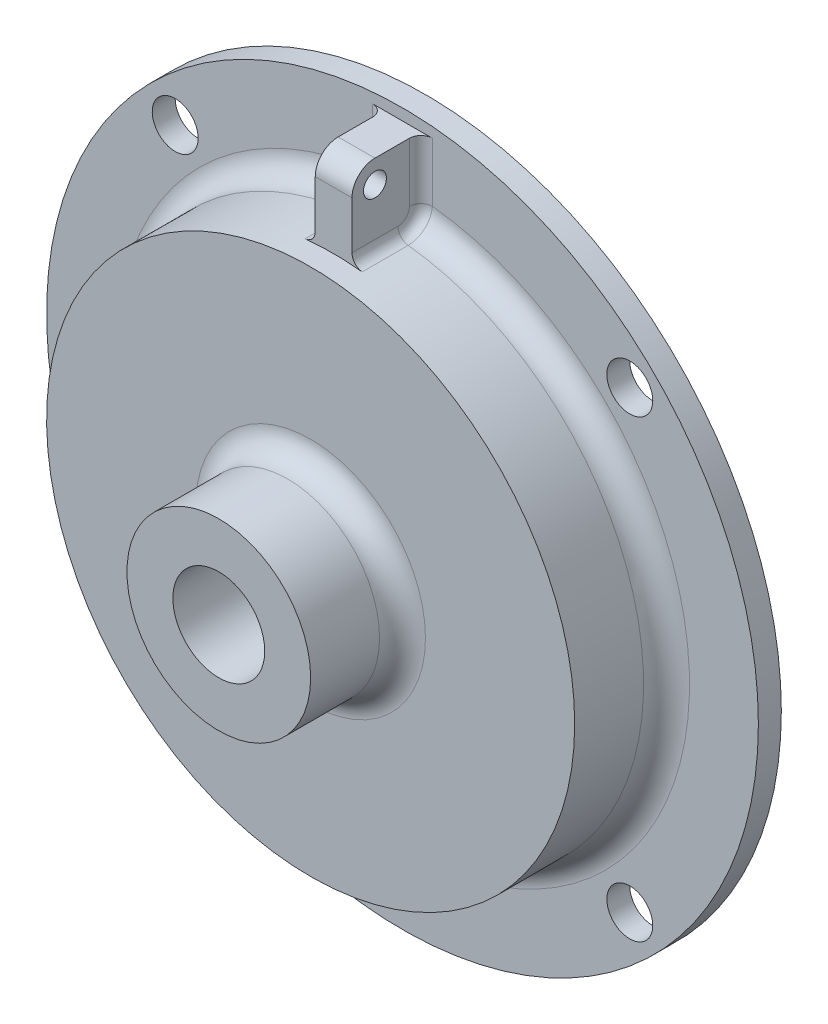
ISO-10303-21;
HEADER;
FILE_DESCRIPTION(('STEP AP214'),'2;1');
FILE_NAME('part.step','',(''),(''),'','','');
FILE_SCHEMA(('AUTOMOTIVE_DESIGN { 1 0 10303 214 1 1 1 1 }'));
ENDSEC;
DATA;
#1=APPLICATION_CONTEXT('core data for automotive mechanical design processes');
#2=APPLICATION_PROTOCOL_DEFINITION('international standard','automotive_design',2000,#1);
#3=PRODUCT_CONTEXT('',#1,'mechanical');
#4=PRODUCT('Part','Part','',(#3));
#5=PRODUCT_RELATED_PRODUCT_CATEGORY('part','',(#4));
#6=PRODUCT_DEFINITION_FORMATION('','',#4);
#7=PRODUCT_DEFINITION_CONTEXT('part definition',#1,'design');
#8=PRODUCT_DEFINITION('design','',#6,#7);
#9=PRODUCT_DEFINITION_SHAPE('','',#8);
#10=(LENGTH_UNIT() NAMED_UNIT(*) SI_UNIT(.MILLI.,.METRE.));
#11=(NAMED_UNIT(*) PLANE_ANGLE_UNIT() SI_UNIT($,.RADIAN.));
#12=(NAMED_UNIT(*) SI_UNIT($,.STERADIAN.) SOLID_ANGLE_UNIT());
#13=UNCERTAINTY_MEASURE_WITH_UNIT(LENGTH_MEASURE(1.E-05),#10,'distance_accuracy_value','');
#14=(GEOMETRIC_REPRESENTATION_CONTEXT(3) GLOBAL_UNCERTAINTY_ASSIGNED_CONTEXT((#13)) GLOBAL_UNIT_ASSIGNED_CONTEXT((#10,
#11,#12)) REPRESENTATION_CONTEXT('',''));
#15=CARTESIAN_POINT('',(0.,0.,0.));
#16=DIRECTION('',(0.,0.,1.));
#17=DIRECTION('',(1.,0.,0.));
#18=AXIS2_PLACEMENT_3D('',#15,#16,#17);
#19=CARTESIAN_POINT('',(0.,0.,3.175));
#20=DIRECTION('',(0.,0.,1.));
#21=DIRECTION('',(1.,0.,0.));
#22=AXIS2_PLACEMENT_3D('',#19,#20,#21);
#23=PLANE('',#22);
#24=CARTESIAN_POINT('',(-31.4308964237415,31.4308964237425,3.175));
#25=DIRECTION('',(0.,0.,1.));
#26=DIRECTION('',(0.,1.,0.));
#27=AXIS2_PLACEMENT_3D('',#24,#25,#26);
#28=CIRCLE('',#27,3.175);
#29=CARTESIAN_POINT('',(-31.4308964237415,34.6058964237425,3.175));
#30=VERTEX_POINT('',#29);
#31=EDGE_CURVE('E369',#30,#30,#28,.T.);
#32=ORIENTED_EDGE('',*,*,#31,.F.);
#33=EDGE_LOOP('',(#32));
#34=FACE_BOUND('',#33,.T.);
#35=CARTESIAN_POINT('',(-31.4308964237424,-31.4308964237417,3.175));
#36=DIRECTION('',(0.,0.,1.));
#37=DIRECTION('',(-1.,0.,0.));
#38=AXIS2_PLACEMENT_3D('',#35,#36,#37);
#39=CIRCLE('',#38,3.175);
#40=CARTESIAN_POINT('',(-34.6058964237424,-31.4308964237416,3.175));
#41=VERTEX_POINT('',#40);
#42=EDGE_CURVE('E375',#41,#41,#39,.T.);
#43=ORIENTED_EDGE('',*,*,#42,.F.);
#44=EDGE_LOOP('',(#43));
#45=FACE_BOUND('',#44,.T.);
#46=CARTESIAN_POINT('',(31.4308964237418,-31.4308964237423,3.175));
#47=DIRECTION('',(0.,0.,1.));
#48=DIRECTION('',(0.,-1.,0.));
#49=AXIS2_PLACEMENT_3D('',#46,#47,#48);
#50=CIRCLE('',#49,3.175);
#51=CARTESIAN_POINT('',(31.4308964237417,-34.6058964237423,3.175));
#52=VERTEX_POINT('',#51);
#53=EDGE_CURVE('E381',#52,#52,#50,.T.);
#54=ORIENTED_EDGE('',*,*,#53,.F.);
#55=EDGE_LOOP('',(#54));
#56=FACE_BOUND('',#55,.T.);
#57=CARTESIAN_POINT('',(31.4308964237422,31.4308964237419,3.175));
#58=DIRECTION('',(0.,0.,1.));
#59=DIRECTION('',(1.,0.,0.));
#60=AXIS2_PLACEMENT_3D('',#57,#58,#59);
#61=CIRCLE('',#60,3.175);
#62=CARTESIAN_POINT('',(34.6058964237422,31.4308964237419,3.175));
#63=VERTEX_POINT('',#62);
#64=EDGE_CURVE('E387',#63,#63,#61,.T.);
#65=ORIENTED_EDGE('',*,*,#64,.F.);
#66=EDGE_LOOP('',(#65));
#67=FACE_BOUND('',#66,.T.);
#68=CARTESIAN_POINT('',(0.,0.,3.175));
#69=DIRECTION('',(0.,0.,1.));
#70=DIRECTION('',(1.,0.,0.));
#71=AXIS2_PLACEMENT_3D('',#68,#69,#70);
#72=CIRCLE('',#71,49.2125);
#73=CARTESIAN_POINT('',(49.2125,0.,3.175));
#74=VERTEX_POINT('',#73);
#75=EDGE_CURVE('E298',#74,#74,#72,.T.);
#76=ORIENTED_EDGE('',*,*,#75,.T.);
#77=EDGE_LOOP('',(#76));
#78=FACE_BOUND('',#77,.T.);
#79=DIRECTION('',(1.,0.,0.));
#80=VECTOR('',#79,1.);
#81=CARTESIAN_POINT('',(-2.54,47.625,3.175));
#82=LINE('',#81,#80);
#83=CARTESIAN_POINT('',(-4.1275,47.625,3.175));
#84=VERTEX_POINT('',#83);
#85=CARTESIAN_POINT('',(4.1275,47.625,3.175));
#86=VERTEX_POINT('',#85);
#87=EDGE_CURVE('E43',#84,#86,#82,.T.);
#88=ORIENTED_EDGE('',*,*,#87,.T.);
#89=DIRECTION('',(0.,-1.,0.));
#90=VECTOR('',#89,1.);
#91=CARTESIAN_POINT('',(4.1275,39.6061365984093,3.175));
#92=LINE('',#91,#90);
#93=CARTESIAN_POINT('',(4.1275,39.4722864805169,3.175));
#94=VERTEX_POINT('',#93);
#95=EDGE_CURVE('E313',#86,#94,#92,.T.);
#96=ORIENTED_EDGE('',*,*,#95,.T.);
#97=CARTESIAN_POINT('',(0.,0.,3.175));
#98=DIRECTION('',(0.,0.,1.));
#99=DIRECTION('',(1.,0.,0.));
#100=AXIS2_PLACEMENT_3D('',#97,#98,#99);
#101=CIRCLE('',#100,39.6875);
#102=CARTESIAN_POINT('',(-4.1275,39.4722864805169,3.175));
#103=VERTEX_POINT('',#102);
#104=EDGE_CURVE('E130',#94,#103,#101,.F.);
#105=ORIENTED_EDGE('',*,*,#104,.T.);
#106=DIRECTION('',(0.,-1.,0.));
#107=VECTOR('',#106,1.);
#108=CARTESIAN_POINT('',(-4.1275,0.,3.175));
#109=LINE('',#108,#107);
#110=EDGE_CURVE('E311',#103,#84,#109,.F.);
#111=ORIENTED_EDGE('',*,*,#110,.T.);
#112=EDGE_LOOP('',(#88,#96,#105,#111));
#113=FACE_BOUND('',#112,.T.);
#114=ADVANCED_FACE('F27',(#34,#45,#56,#67,#78,#113),#23,.T.);
#115=CARTESIAN_POINT('',(0.,0.,15.875));
#116=DIRECTION('',(0.,0.,-1.));
#117=DIRECTION('',(-1.,0.,0.));
#118=AXIS2_PLACEMENT_3D('',#115,#116,#117);
#119=CYLINDRICAL_SURFACE('',#118,36.5125);
#120=CARTESIAN_POINT('',(0.,0.,15.875));
#121=DIRECTION('',(0.,0.,1.));
#122=DIRECTION('',(1.,0.,0.));
#123=AXIS2_PLACEMENT_3D('',#120,#121,#122);
#124=CIRCLE('',#123,36.5125);
#125=CARTESIAN_POINT('',(36.5125,0.,15.875));
#126=VERTEX_POINT('',#125);
#127=EDGE_CURVE('E361',#126,#126,#124,.T.);
#128=ORIENTED_EDGE('',*,*,#127,.F.);
#129=EDGE_LOOP('',(#128));
#130=FACE_BOUND('',#129,.T.);
#131=CARTESIAN_POINT('',(0.,0.,6.35));
#132=DIRECTION('',(0.,0.,1.));
#133=DIRECTION('',(1.,0.,0.));
#134=AXIS2_PLACEMENT_3D('',#131,#132,#133);
#135=CIRCLE('',#134,36.5125);
#136=CARTESIAN_POINT('',(-3.95552083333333,36.2976102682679,6.35));
#137=VERTEX_POINT('',#136);
#138=CARTESIAN_POINT('',(3.95552083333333,36.2976102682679,6.35));
#139=VERTEX_POINT('',#138);
#140=EDGE_CURVE('E300',#137,#139,#135,.T.);
#141=ORIENTED_EDGE('',*,*,#140,.T.);
#142=DIRECTION('',(0.,0.,-1.));
#143=VECTOR('',#142,1.);
#144=CARTESIAN_POINT('',(3.95552083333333,36.2976102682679,15.875));
#145=LINE('',#144,#143);
#146=CARTESIAN_POINT('',(3.95552083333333,36.2976102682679,12.7));
#147=VERTEX_POINT('',#146);
#148=EDGE_CURVE('E136',#139,#147,#145,.F.);
#149=ORIENTED_EDGE('',*,*,#148,.T.);
#150=CARTESIAN_POINT('',(0.,0.,12.7));
#151=DIRECTION('',(0.,0.,-1.));
#152=DIRECTION('',(-1.,0.,0.));
#153=AXIS2_PLACEMENT_3D('',#150,#151,#152);
#154=CIRCLE('',#153,36.5125);
#155=CARTESIAN_POINT('',(-3.95552083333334,36.2976102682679,12.7));
#156=VERTEX_POINT('',#155);
#157=EDGE_CURVE('E127',#156,#147,#154,.T.);
#158=ORIENTED_EDGE('',*,*,#157,.F.);
#159=DIRECTION('',(0.,0.,-1.));
#160=VECTOR('',#159,1.);
#161=CARTESIAN_POINT('',(-3.95552083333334,36.2976102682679,15.875));
#162=LINE('',#161,#160);
#163=EDGE_CURVE('E121',#156,#137,#162,.T.);
#164=ORIENTED_EDGE('',*,*,#163,.T.);
#165=EDGE_LOOP('',(#141,#149,#158,#164));
#166=FACE_BOUND('',#165,.T.);
#167=ADVANCED_FACE('F243',(#130,#166),#119,.T.);
#168=CARTESIAN_POINT('',(0.,0.,6.35));
#169=DIRECTION('',(0.,0.,1.));
#170=DIRECTION('',(1.,0.,0.));
#171=AXIS2_PLACEMENT_3D('',#168,#169,#170);
#172=TOROIDAL_SURFACE('',#171,39.6875,3.175);
#173=ORIENTED_EDGE('',*,*,#104,.F.);
#174=CARTESIAN_POINT('',(4.18164310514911,40.5273921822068,3.35542367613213));
#175=CARTESIAN_POINT('',(2.54,40.5459208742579,3.30255416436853));
#176=CARTESIAN_POINT('',(2.54,40.0026513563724,4.85271183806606));
#177=CARTESIAN_POINT('',(4.17735707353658,40.4427545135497,3.32560729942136));
#178=CARTESIAN_POINT('',(2.54,40.4584003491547,3.27658082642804));
#179=CARTESIAN_POINT('',(2.54,39.96011140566,4.83780364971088));
#180=CARTESIAN_POINT('',(4.17299607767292,40.3569071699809,3.29939836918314));
#181=CARTESIAN_POINT('',(2.54,40.3698846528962,3.25440113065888));
#182=CARTESIAN_POINT('',(2.54,39.9169623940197,4.8246991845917));
#183=CARTESIAN_POINT('',(4.16414950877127,40.1833322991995,3.25433784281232));
#184=CARTESIAN_POINT('',(2.54,40.1916864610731,3.21776571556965));
#185=CARTESIAN_POINT('',(2.54,39.8297170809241,4.80216892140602));
#186=CARTESIAN_POINT('',(4.15966394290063,40.0956048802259,3.23548582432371));
#187=CARTESIAN_POINT('',(2.54,40.1020134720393,3.20328878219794));
#188=CARTESIAN_POINT('',(2.54,39.7856208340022,4.79274291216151));
#189=CARTESIAN_POINT('',(4.14607190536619,39.8306740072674,3.19022168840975));
#190=CARTESIAN_POINT('',(2.54,39.8327789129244,3.17154593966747));
#191=CARTESIAN_POINT('',(2.54,39.6524495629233,4.77011084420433));
#192=CARTESIAN_POINT('',(4.13681647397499,39.6514527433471,3.17500699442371));
#193=CARTESIAN_POINT('',(2.54,39.6519801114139,3.16566305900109));
#194=CARTESIAN_POINT('',(2.54,39.5623567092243,4.76250349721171));
#195=CARTESIAN_POINT('',(4.11817420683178,39.2929409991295,3.17499299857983));
#196=CARTESIAN_POINT('',(2.54,39.2934661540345,3.18429156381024));
#197=CARTESIAN_POINT('',(2.54,39.3821261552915,4.76249649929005));
#198=CARTESIAN_POINT('',(4.10878724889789,39.1136506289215,3.19022413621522));
#199=CARTESIAN_POINT('',(2.54,39.1157385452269,3.20865546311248));
#200=CARTESIAN_POINT('',(2.54,39.2919885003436,4.77011206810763));
#201=CARTESIAN_POINT('',(4.09015568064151,38.7601767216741,3.25070280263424));
#202=CARTESIAN_POINT('',(2.54,38.7683278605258,3.28634323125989));
#203=CARTESIAN_POINT('',(2.54,39.1142707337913,4.80035140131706));
#204=CARTESIAN_POINT('',(4.08091104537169,38.5859922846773,3.29594500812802));
#205=CARTESIAN_POINT('',(2.54,38.598573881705,3.3395012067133));
#206=CARTESIAN_POINT('',(2.54,39.0266901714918,4.82297250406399));
#207=CARTESIAN_POINT('',(4.06283875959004,38.2476492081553,3.41520930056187));
#208=CARTESIAN_POINT('',(2.54,38.2714996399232,3.47265785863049));
#209=CARTESIAN_POINT('',(2.54,38.8565608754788,4.88260465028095));
#210=CARTESIAN_POINT('',(4.05401116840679,38.0834919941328,3.48923546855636));
#211=CARTESIAN_POINT('',(2.54,38.1140639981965,3.5525334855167));
#212=CARTESIAN_POINT('',(2.54,38.7740128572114,4.91961773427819));
#213=CARTESIAN_POINT('',(4.03704864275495,37.7698994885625,3.66402328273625));
#214=CARTESIAN_POINT('',(2.54,37.8155483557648,3.73642917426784));
#215=CARTESIAN_POINT('',(2.54,38.6163119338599,5.00701164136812));
#216=CARTESIAN_POINT('',(4.02891377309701,37.6204655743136,3.76478742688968));
#217=CARTESIAN_POINT('',(2.54,37.6743195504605,3.8403710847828));
#218=CARTESIAN_POINT('',(2.54,38.541159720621,5.05739371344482));
#219=CARTESIAN_POINT('',(4.01362149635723,37.3409931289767,3.98996063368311));
#220=CARTESIAN_POINT('',(2.54,37.4119377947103,4.06894628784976));
#221=CARTESIAN_POINT('',(2.54,38.4006031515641,5.16998031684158));
#222=CARTESIAN_POINT('',(4.00646176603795,37.2109084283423,4.11431174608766));
#223=CARTESIAN_POINT('',(2.54,37.2905724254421,4.19350133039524));
#224=CARTESIAN_POINT('',(2.54,38.335175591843,5.23215587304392));
#225=CARTESIAN_POINT('',(3.99333719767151,36.9734608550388,4.38333826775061));
#226=CARTESIAN_POINT('',(2.54,37.0702855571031,4.45996271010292));
#227=CARTESIAN_POINT('',(2.54,38.2157441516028,5.36666913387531));
#228=CARTESIAN_POINT('',(3.98737253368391,36.8661012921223,4.52801663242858));
#229=CARTESIAN_POINT('',(2.54,36.971202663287,4.60190105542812));
#230=CARTESIAN_POINT('',(2.54,38.1617419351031,5.43900831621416));
#231=CARTESIAN_POINT('',(3.97687425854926,36.6777509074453,4.83284333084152));
#232=CARTESIAN_POINT('',(2.54,36.798155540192,4.89857518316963));
#233=CARTESIAN_POINT('',(2.54,38.0669983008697,5.59142166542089));
#234=CARTESIAN_POINT('',(3.97233377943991,36.5966334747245,4.99291240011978));
#235=CARTESIAN_POINT('',(2.54,36.7239275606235,5.05332299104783));
#236=CARTESIAN_POINT('',(2.54,38.0261932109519,5.67145620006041));
#237=CARTESIAN_POINT('',(3.96481003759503,36.4625045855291,5.3242894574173));
#238=CARTESIAN_POINT('',(2.54,36.6015930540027,5.37195514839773));
#239=CARTESIAN_POINT('',(2.54,37.9587200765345,5.83714472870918));
#240=CARTESIAN_POINT('',(3.96182512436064,36.4094633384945,5.49558531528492));
#241=CARTESIAN_POINT('',(2.54,36.5533484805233,5.53595146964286));
#242=CARTESIAN_POINT('',(2.54,37.9320370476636,5.9227926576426));
#243=CARTESIAN_POINT('',(3.95692027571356,36.3223814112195,5.89322764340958));
#244=CARTESIAN_POINT('',(2.54,36.4743136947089,5.91537906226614));
#245=CARTESIAN_POINT('',(2.54,37.8882290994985,6.12161382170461));
#246=CARTESIAN_POINT('',(3.9555216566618,36.2976254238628,6.12171939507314));
#247=CARTESIAN_POINT('',(2.54,36.4518799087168,6.13287630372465));
#248=CARTESIAN_POINT('',(2.54,37.8757748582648,6.23585969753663));
#249=CARTESIAN_POINT('',(3.95552019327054,36.2975984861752,6.52746734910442));
#250=CARTESIAN_POINT('',(2.54,36.4518555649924,6.51879379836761));
#251=CARTESIAN_POINT('',(2.54,37.8757613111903,6.43873367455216));
#252=CARTESIAN_POINT('',(3.95636433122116,36.3125391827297,6.70480708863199));
#253=CARTESIAN_POINT('',(2.54,36.4653926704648,6.68754708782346));
#254=CARTESIAN_POINT('',(2.54,37.8832776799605,6.52740354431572));
#255=CARTESIAN_POINT('',(3.959701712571,36.3717606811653,7.05520561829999));
#256=CARTESIAN_POINT('',(2.54,36.5191030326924,7.0215028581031));
#257=CARTESIAN_POINT('',(2.54,37.9130701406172,6.70260280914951));
#258=CARTESIAN_POINT('',(3.9622017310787,36.4161620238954,7.22824377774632));
#259=CARTESIAN_POINT('',(2.54,36.5594364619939,7.18684096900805));
#260=CARTESIAN_POINT('',(2.54,37.9354068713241,6.7891218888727));
#261=CARTESIAN_POINT('',(3.96550570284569,36.4749456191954,7.39635872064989));
#262=CARTESIAN_POINT('',(2.54,36.6129150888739,7.34791496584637));
#263=CARTESIAN_POINT('',(2.54,37.964978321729,6.87317936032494));
#264=(BOUNDED_SURFACE() B_SPLINE_SURFACE(3,2,((#174,#175,#176),(#177,#178,#179),(#180,#181,
#182),(#183,#184,#185),(#186,#187,#188),(#189,#190,#191),(#192,#193,#194),(#195,#196,#197),
(#198,#199,#200),(#201,#202,#203),(#204,#205,#206),(#207,#208,#209),(#210,#211,#212),(#213,#214,
#215),(#216,#217,#218),(#219,#220,#221),(#222,#223,#224),(#225,#226,#227),(#228,#229,#230),
(#231,#232,#233),(#234,#235,#236),(#237,#238,#239),(#240,#241,#242),(#243,#244,#245),(#246,#247,
#248),(#249,#250,#251),(#252,#253,#254),(#255,#256,#257),(#258,#259,#260),(#261,#262,#263)),
.UNSPECIFIED.,.F.,.F.,.F.) B_SPLINE_SURFACE_WITH_KNOTS((4,2,2,2,2,2,2,2,2,2,2,2,2,2,4),(3,3),
(0.,0.135146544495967,0.270285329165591,0.540138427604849,0.810261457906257,1.08033658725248,
1.35045002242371,1.62058870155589,1.89007208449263,2.15959468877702,2.42779682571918,
2.69571381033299,3.03757625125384,3.30334311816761,3.5702041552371),(0.,1.),
.UNSPECIFIED.) GEOMETRIC_REPRESENTATION_ITEM() RATIONAL_B_SPLINE_SURFACE(((1.,0.694943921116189,
1.),(1.,0.695915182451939,1.),(1.,0.696901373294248,1.),(1.,0.698897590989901,1.),(1.,
0.699907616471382,1.),(1.,0.702961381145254,1.),(1.,0.70503189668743,1.),(1.,0.709183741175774,
1.),(1.,0.711265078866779,1.),(1.,0.715378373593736,1.),(1.,0.717410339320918,1.),(1.,
0.721366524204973,1.),(1.,0.723290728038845,1.),(1.,0.726974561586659,1.),(1.,0.728734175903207,
1.),(1.,0.732031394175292,1.),(1.,0.733569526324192,1.),(1.,0.736381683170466,1.),(1.,
0.737655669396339,1.),(1.,0.739893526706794,1.),(1.,0.740858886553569,1.),(1.,0.742456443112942,
1.),(1.,0.743088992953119,1.),(1.,0.744127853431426,1.),(1.,0.744423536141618,1.),(1.,
0.744423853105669,1.),(1.,0.744245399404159,1.),(1.,0.743538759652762,1.),(1.,0.743009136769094,
1.),(1.,0.742308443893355,1.))) REPRESENTATION_ITEM('') SURFACE());
#265=CARTESIAN_POINT('',(4.18164310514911,40.5273921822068,3.35542367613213));
#266=CARTESIAN_POINT('',(4.17735707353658,40.4427545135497,3.32560729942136));
#267=CARTESIAN_POINT('',(4.17299607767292,40.3569071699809,3.29939836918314));
#268=CARTESIAN_POINT('',(4.16414950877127,40.1833322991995,3.25433784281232));
#269=CARTESIAN_POINT('',(4.15966394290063,40.0956048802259,3.23548582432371));
#270=CARTESIAN_POINT('',(4.14607190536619,39.8306740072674,3.19022168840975));
#271=CARTESIAN_POINT('',(4.13681647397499,39.6514527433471,3.17500699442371));
#272=CARTESIAN_POINT('',(4.11817420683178,39.2929409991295,3.17499299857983));
#273=CARTESIAN_POINT('',(4.10878724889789,39.1136506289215,3.19022413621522));
#274=CARTESIAN_POINT('',(4.09015568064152,38.7601767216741,3.25070280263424));
#275=CARTESIAN_POINT('',(4.08091104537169,38.5859922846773,3.29594500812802));
#276=CARTESIAN_POINT('',(4.06283875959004,38.2476492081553,3.41520930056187));
#277=CARTESIAN_POINT('',(4.05401116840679,38.0834919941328,3.48923546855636));
#278=CARTESIAN_POINT('',(4.03704864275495,37.7698994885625,3.66402328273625));
#279=CARTESIAN_POINT('',(4.02891377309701,37.6204655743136,3.76478742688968));
#280=CARTESIAN_POINT('',(4.01362149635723,37.3409931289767,3.98996063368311));
#281=CARTESIAN_POINT('',(4.00646176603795,37.2109084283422,4.11431174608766));
#282=CARTESIAN_POINT('',(3.99333719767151,36.9734608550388,4.38333826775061));
#283=CARTESIAN_POINT('',(3.98737253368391,36.8661012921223,4.52801663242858));
#284=CARTESIAN_POINT('',(3.97687425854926,36.6777509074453,4.83284333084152));
#285=CARTESIAN_POINT('',(3.97233377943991,36.5966334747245,4.99291240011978));
#286=CARTESIAN_POINT('',(3.96481003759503,36.4625045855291,5.3242894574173));
#287=CARTESIAN_POINT('',(3.96182512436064,36.4094633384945,5.49558531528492));
#288=CARTESIAN_POINT('',(3.95692027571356,36.3223814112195,5.89322764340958));
#289=CARTESIAN_POINT('',(3.9555216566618,36.2976254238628,6.12171939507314));
#290=CARTESIAN_POINT('',(3.95552019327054,36.2975984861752,6.52746734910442));
#291=CARTESIAN_POINT('',(3.95636433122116,36.3125391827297,6.70480708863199));
#292=CARTESIAN_POINT('',(3.959701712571,36.3717606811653,7.05520561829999));
#293=CARTESIAN_POINT('',(3.9622017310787,36.4161620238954,7.22824377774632));
#294=CARTESIAN_POINT('',(3.96550570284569,36.4749456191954,7.39635872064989));
#295=B_SPLINE_CURVE_WITH_KNOTS('',3,(#265,#266,#267,#268,#269,#270,#271,#272,#273,#274,#275,
#276,#277,#278,#279,#280,#281,#282,#283,#284,#285,#286,#287,#288,#289,#290,#291,#292,#293,#294),
.UNSPECIFIED.,.F.,.F.,(4,2,2,2,2,2,2,2,2,2,2,2,2,2,4),(0.,0.135146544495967,0.270285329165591,
0.540138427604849,0.810261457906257,1.08033658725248,1.35045002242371,1.62058870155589,
1.89007208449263,2.15959468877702,2.42779682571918,2.69571381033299,3.03757625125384,
3.30334311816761,3.5702041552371),.UNSPECIFIED.);
#296=EDGE_CURVE('E319',#94,#139,#295,.T.);
#297=ORIENTED_EDGE('',*,*,#296,.T.);
#298=ORIENTED_EDGE('',*,*,#140,.F.);
#299=CARTESIAN_POINT('',(-3.96550570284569,36.4749456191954,7.39635872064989));
#300=CARTESIAN_POINT('',(-2.54,36.6129150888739,7.34791496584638));
#301=CARTESIAN_POINT('',(-2.54,37.964978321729,6.87317936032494));
#302=CARTESIAN_POINT('',(-3.96386052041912,36.4456596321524,7.31244061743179));
#303=CARTESIAN_POINT('',(-2.54,36.5862605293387,7.26747359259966));
#304=CARTESIAN_POINT('',(-2.54,37.9502458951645,6.83122030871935));
#305=CARTESIAN_POINT('',(-3.96241213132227,36.4199078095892,7.22731888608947));
#306=CARTESIAN_POINT('',(-2.54,36.5628409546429,7.18600002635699));
#307=CARTESIAN_POINT('',(-2.54,37.9372912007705,6.78865944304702));
#308=CARTESIAN_POINT('',(-3.95991943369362,36.375622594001,7.05519929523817));
#309=CARTESIAN_POINT('',(-2.54,36.5226091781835,7.0215333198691));
#310=CARTESIAN_POINT('',(-2.54,37.9150129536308,6.70259964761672));
#311=CARTESIAN_POINT('',(-3.95887510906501,36.357088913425,6.96820151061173));
#312=CARTESIAN_POINT('',(-2.54,36.5057873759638,6.93852233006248));
#313=CARTESIAN_POINT('',(-2.54,37.9056892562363,6.6591007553));
#314=CARTESIAN_POINT('',(-3.95636653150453,36.3125856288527,6.70546681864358));
#315=CARTESIAN_POINT('',(-2.54,36.4654342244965,6.68817541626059));
#316=CARTESIAN_POINT('',(-2.54,37.8833010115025,6.5277334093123));
#317=CARTESIAN_POINT('',(-3.95552123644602,36.2976172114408,6.52771107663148));
#318=CARTESIAN_POINT('',(-2.54,36.4518725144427,6.51902588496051));
#319=CARTESIAN_POINT('',(-2.54,37.8757707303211,6.43885553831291));
#320=CARTESIAN_POINT('',(-3.9555204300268,36.2976033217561,6.17220346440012));
#321=CARTESIAN_POINT('',(-2.54,36.4518599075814,6.18089287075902));
#322=CARTESIAN_POINT('',(-2.54,37.8757637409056,6.26110173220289));
#323=CARTESIAN_POINT('',(-3.95636573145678,36.3125722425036,5.99445163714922));
#324=CARTESIAN_POINT('',(-2.54,36.4654220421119,6.01174700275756));
#325=CARTESIAN_POINT('',(-2.54,37.8832942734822,6.17222581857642));
#326=CARTESIAN_POINT('',(-3.95971478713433,36.3719843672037,5.64402081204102));
#327=CARTESIAN_POINT('',(-2.54,36.5193066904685,5.67775874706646));
#328=CARTESIAN_POINT('',(-2.54,37.9131827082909,5.99701040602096));
#329=CARTESIAN_POINT('',(-3.96221821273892,36.4164217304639,5.47134081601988));
#330=CARTESIAN_POINT('',(-2.54,36.559674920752,5.51276159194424));
#331=CARTESIAN_POINT('',(-2.54,37.9355376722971,5.91067040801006));
#332=CARTESIAN_POINT('',(-3.96879290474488,36.5334643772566,5.13595644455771));
#333=CARTESIAN_POINT('',(-2.54,36.6662507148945,5.19112038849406));
#334=CARTESIAN_POINT('',(-2.54,37.994416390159,5.74297822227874));
#335=CARTESIAN_POINT('',(-3.97286403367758,36.6060671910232,4.97325119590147));
#336=CARTESIAN_POINT('',(-2.54,36.732552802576,5.03434604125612));
#337=CARTESIAN_POINT('',(-2.54,38.0309389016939,5.66162559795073));
#338=CARTESIAN_POINT('',(-3.98243029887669,36.7773369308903,4.662347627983));
#339=CARTESIAN_POINT('',(-2.54,36.8895262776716,4.73299568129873));
#340=CARTESIAN_POINT('',(-2.54,38.1170922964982,5.50617381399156));
#341=CARTESIAN_POINT('',(-3.98792562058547,36.8760072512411,4.51415120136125));
#342=CARTESIAN_POINT('',(-2.54,36.9803334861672,4.58832951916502));
#343=CARTESIAN_POINT('',(-2.54,38.1667248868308,5.43207560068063));
#344=CARTESIAN_POINT('',(-4.00016593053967,37.096846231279,4.23606432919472));
#345=CARTESIAN_POINT('',(-2.54,37.1845533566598,4.31454545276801));
#346=CARTESIAN_POINT('',(-2.54,38.2778052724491,5.29303216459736));
#347=CARTESIAN_POINT('',(-4.00691405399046,37.2190738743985,4.10622128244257));
#348=CARTESIAN_POINT('',(-2.54,37.2981778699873,4.18542455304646));
#349=CARTESIAN_POINT('',(-2.54,38.339282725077,5.22811064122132));
#350=CARTESIAN_POINT('',(-4.02142580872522,37.4833934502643,3.86886173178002));
#351=CARTESIAN_POINT('',(-2.54,37.5453465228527,3.94656479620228));
#352=CARTESIAN_POINT('',(-2.54,38.4722223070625,5.10943086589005));
#353=CARTESIAN_POINT('',(-4.02918961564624,37.6254888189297,3.76134909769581));
#354=CARTESIAN_POINT('',(-2.54,37.6790567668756,3.83683770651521));
#355=CARTESIAN_POINT('',(-2.54,38.5436861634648,5.05567454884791));
#356=CARTESIAN_POINT('',(-4.04552882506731,37.9263814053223,3.57106039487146));
#357=CARTESIAN_POINT('',(-2.54,37.9641416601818,3.63929294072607));
#358=CARTESIAN_POINT('',(-2.54,38.6950055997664,4.96053019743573));
#359=CARTESIAN_POINT('',(-4.05410876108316,38.0852725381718,3.48843456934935));
#360=CARTESIAN_POINT('',(-2.54,38.1157665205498,3.55167383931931));
#361=CARTESIAN_POINT('',(-2.54,38.7749083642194,4.9192172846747));
#362=CARTESIAN_POINT('',(-4.0717679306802,38.4144708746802,3.35110687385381));
#363=CARTESIAN_POINT('',(-2.54,38.4323282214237,3.40197931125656));
#364=CARTESIAN_POINT('',(-2.54,38.9404454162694,4.85055343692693));
#365=CARTESIAN_POINT('',(-4.08084670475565,38.5847676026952,3.29637976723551));
#366=CARTESIAN_POINT('',(-2.54,38.5973814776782,3.33999077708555));
#367=CARTESIAN_POINT('',(-2.54,39.0260744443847,4.82318988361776));
#368=CARTESIAN_POINT('',(-4.09623072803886,38.8753034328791,3.22931466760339));
#369=CARTESIAN_POINT('',(-2.54,38.8810436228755,3.25946594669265));
#370=CARTESIAN_POINT('',(-2.54,39.172154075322,4.78965733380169));
#371=CARTESIAN_POINT('',(-4.10247573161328,38.9937714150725,3.20897494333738));
#372=CARTESIAN_POINT('',(-2.54,38.9974684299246,3.23335877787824));
#373=CARTESIAN_POINT('',(-2.54,39.2317168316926,4.77948747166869));
#374=CARTESIAN_POINT('',(-4.11498864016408,39.2322281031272,3.18181315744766));
#375=CARTESIAN_POINT('',(-2.54,39.2331650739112,3.19421185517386));
#376=CARTESIAN_POINT('',(-2.54,39.3516024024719,4.76590657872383));
#377=CARTESIAN_POINT('',(-4.12125654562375,39.3522168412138,3.17499138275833));
#378=CARTESIAN_POINT('',(-2.54,39.3524524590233,3.18122275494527));
#379=CARTESIAN_POINT('',(-2.54,39.4119252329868,4.76249569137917));
#380=CARTESIAN_POINT('',(-4.13679822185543,39.6511032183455,3.17501283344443));
#381=CARTESIAN_POINT('',(-2.54,39.6516284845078,3.16568710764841));
#382=CARTESIAN_POINT('',(-2.54,39.5621809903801,4.76250641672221));
#383=CARTESIAN_POINT('',(-4.14604221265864,39.830099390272,3.19017507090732));
#384=CARTESIAN_POINT('',(-2.54,39.8321975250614,3.17152918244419));
#385=CARTESIAN_POINT('',(-2.54,39.6521607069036,4.77008753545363));
#386=CARTESIAN_POINT('',(-4.15962981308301,40.0949375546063,3.235346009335));
#387=CARTESIAN_POINT('',(-2.54,40.101332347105,3.20318244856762));
#388=CARTESIAN_POINT('',(-2.54,39.7852854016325,4.79267300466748));
#389=CARTESIAN_POINT('',(-4.16412306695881,40.1828141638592,3.25421340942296));
#390=CARTESIAN_POINT('',(-2.54,40.1911560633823,3.2176668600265));
#391=CARTESIAN_POINT('',(-2.54,39.8294566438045,4.80210670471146));
#392=CARTESIAN_POINT('',(-4.17298344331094,40.3566586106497,3.2993238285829));
#393=CARTESIAN_POINT('',(-2.54,40.3696287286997,3.25433836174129));
#394=CARTESIAN_POINT('',(-2.54,39.916837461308,4.82466191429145));
#395=CARTESIAN_POINT('',(-4.17735059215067,40.442626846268,3.32556529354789));
#396=CARTESIAN_POINT('',(-2.54,40.4582685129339,3.27654470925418));
#397=CARTESIAN_POINT('',(-2.54,39.960047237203,4.83778264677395));
#398=CARTESIAN_POINT('',(-4.18164310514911,40.5273921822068,3.35542367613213));
#399=CARTESIAN_POINT('',(-2.54,40.5459208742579,3.30255416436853));
#400=CARTESIAN_POINT('',(-2.54,40.0026513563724,4.85271183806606));
#401=(BOUNDED_SURFACE() B_SPLINE_SURFACE(3,2,((#299,#300,#301),(#302,#303,#304),(#305,#306,
#307),(#308,#309,#310),(#311,#312,#313),(#314,#315,#316),(#317,#318,#319),(#320,#321,#322),
(#323,#324,#325),(#326,#327,#328),(#329,#330,#331),(#332,#333,#334),(#335,#336,#337),(#338,#339,
#340),(#341,#342,#343),(#344,#345,#346),(#347,#348,#349),(#350,#351,#352),(#353,#354,#355),
(#356,#357,#358),(#359,#360,#361),(#362,#363,#364),(#365,#366,#367),(#368,#369,#370),(#371,#372,
#373),(#374,#375,#376),(#377,#378,#379),(#380,#381,#382),(#383,#384,#385),(#386,#387,#388),
(#389,#390,#391),(#392,#393,#394),(#395,#396,#397),(#398,#399,#400)),.UNSPECIFIED.,.F.,.F.,
.F.) B_SPLINE_SURFACE_WITH_KNOTS((4,2,2,2,2,2,2,2,2,2,2,2,2,2,2,2,4),(3,3),(0.,
0.133329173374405,0.266653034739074,0.532865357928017,0.79920569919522,1.06549326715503,
1.33175749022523,1.59805640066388,1.86503094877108,2.13205172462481,2.40065362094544,
2.66901211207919,2.84992337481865,3.0308384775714,3.30027085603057,3.4356386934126,
3.57097802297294),(0.,1.),
.UNSPECIFIED.) GEOMETRIC_REPRESENTATION_ITEM() RATIONAL_B_SPLINE_SURFACE(((1.,0.742308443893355,
1.),(1.,0.742657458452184,1.),(1.,0.74296449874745,1.),(1.,0.743492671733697,1.),(1.,
0.743713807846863,1.),(1.,0.744244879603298,1.),(1.,0.744423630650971,1.),(1.,0.744423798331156,
1.),(1.,0.744245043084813,1.),(1.,0.743536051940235,1.),(1.,0.743005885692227,1.),(1.,
0.741611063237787,1.),(1.,0.740746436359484,1.),(1.,0.738709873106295,1.),(1.,0.737537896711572,
1.),(1.,0.734919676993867,1.),(1.,0.733472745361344,1.),(1.,0.73035034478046,1.),(1.,
0.728674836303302,1.),(1.,0.725135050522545,1.),(1.,0.723269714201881,1.),(1.,0.71941442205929,
1.),(1.,0.717424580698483,1.),(1.,0.714038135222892,1.),(1.,0.712659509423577,1.),(1.,
0.709889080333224,1.),(1.,0.708497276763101,1.),(1.,0.705035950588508,1.),(1.,0.702968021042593,
1.),(1.,0.699915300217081,1.),(1.,0.69890355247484,1.),(1.,0.696904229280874,1.),(1.,
0.69591664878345,1.),(1.,0.694943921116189,1.))) REPRESENTATION_ITEM('') SURFACE());
#402=CARTESIAN_POINT('',(-3.96550570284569,36.4749456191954,7.39635872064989));
#403=CARTESIAN_POINT('',(-3.96386052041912,36.4456596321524,7.3124406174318));
#404=CARTESIAN_POINT('',(-3.96241213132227,36.4199078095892,7.22731888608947));
#405=CARTESIAN_POINT('',(-3.95991943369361,36.375622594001,7.05519929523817));
#406=CARTESIAN_POINT('',(-3.95887510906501,36.357088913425,6.96820151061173));
#407=CARTESIAN_POINT('',(-3.95636653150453,36.3125856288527,6.70546681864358));
#408=CARTESIAN_POINT('',(-3.95552123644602,36.2976172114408,6.52771107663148));
#409=CARTESIAN_POINT('',(-3.9555204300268,36.2976033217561,6.17220346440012));
#410=CARTESIAN_POINT('',(-3.95636573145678,36.3125722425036,5.99445163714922));
#411=CARTESIAN_POINT('',(-3.95971478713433,36.3719843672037,5.64402081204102));
#412=CARTESIAN_POINT('',(-3.96221821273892,36.4164217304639,5.47134081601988));
#413=CARTESIAN_POINT('',(-3.96879290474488,36.5334643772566,5.13595644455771));
#414=CARTESIAN_POINT('',(-3.97286403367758,36.6060671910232,4.97325119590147));
#415=CARTESIAN_POINT('',(-3.98243029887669,36.7773369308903,4.662347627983));
#416=CARTESIAN_POINT('',(-3.98792562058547,36.8760072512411,4.51415120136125));
#417=CARTESIAN_POINT('',(-4.00016593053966,37.096846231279,4.23606432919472));
#418=CARTESIAN_POINT('',(-4.00691405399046,37.2190738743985,4.10622128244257));
#419=CARTESIAN_POINT('',(-4.02142580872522,37.4833934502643,3.86886173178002));
#420=CARTESIAN_POINT('',(-4.02918961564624,37.6254888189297,3.76134909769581));
#421=CARTESIAN_POINT('',(-4.04552882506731,37.9263814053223,3.57106039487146));
#422=CARTESIAN_POINT('',(-4.05410876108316,38.0852725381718,3.48843456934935));
#423=CARTESIAN_POINT('',(-4.0717679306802,38.4144708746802,3.35110687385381));
#424=CARTESIAN_POINT('',(-4.08084670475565,38.5847676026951,3.29637976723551));
#425=CARTESIAN_POINT('',(-4.09623072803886,38.8753034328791,3.22931466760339));
#426=CARTESIAN_POINT('',(-4.10247573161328,38.9937714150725,3.20897494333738));
#427=CARTESIAN_POINT('',(-4.11498864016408,39.2322281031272,3.18181315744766));
#428=CARTESIAN_POINT('',(-4.12125654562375,39.3522168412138,3.17499138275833));
#429=CARTESIAN_POINT('',(-4.13679822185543,39.6511032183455,3.17501283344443));
#430=CARTESIAN_POINT('',(-4.14604221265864,39.830099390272,3.19017507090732));
#431=CARTESIAN_POINT('',(-4.15962981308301,40.0949375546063,3.235346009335));
#432=CARTESIAN_POINT('',(-4.16412306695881,40.1828141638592,3.25421340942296));
#433=CARTESIAN_POINT('',(-4.17298344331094,40.3566586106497,3.2993238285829));
#434=CARTESIAN_POINT('',(-4.17735059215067,40.442626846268,3.32556529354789));
#435=CARTESIAN_POINT('',(-4.18164310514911,40.5273921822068,3.35542367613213));
#436=B_SPLINE_CURVE_WITH_KNOTS('',3,(#402,#403,#404,#405,#406,#407,#408,#409,#410,#411,#412,
#413,#414,#415,#416,#417,#418,#419,#420,#421,#422,#423,#424,#425,#426,#427,#428,#429,#430,#431,
#432,#433,#434,#435),.UNSPECIFIED.,.F.,.F.,(4,2,2,2,2,2,2,2,2,2,2,2,2,2,2,2,4),(0.,
0.133329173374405,0.266653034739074,0.532865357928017,0.79920569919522,1.06549326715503,
1.33175749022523,1.59805640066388,1.86503094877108,2.13205172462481,2.40065362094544,
2.66901211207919,2.84992337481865,3.0308384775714,3.30027085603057,3.4356386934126,
3.57097802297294),.UNSPECIFIED.);
#437=EDGE_CURVE('E323',#137,#103,#436,.T.);
#438=ORIENTED_EDGE('',*,*,#437,.T.);
#439=EDGE_LOOP('',(#173,#297,#298,#438));
#440=FACE_BOUND('',#439,.T.);
#441=ADVANCED_FACE('F174',(#440),#172,.F.);
#442=CARTESIAN_POINT('',(0.,0.,15.875));
#443=DIRECTION('',(0.,0.,1.));
#444=DIRECTION('',(1.,0.,0.));
#445=AXIS2_PLACEMENT_3D('',#442,#443,#444);
#446=PLANE('',#445);
#447=CARTESIAN_POINT('',(0.,0.,15.875));
#448=DIRECTION('',(0.,0.,1.));
#449=DIRECTION('',(1.,0.,0.));
#450=AXIS2_PLACEMENT_3D('',#447,#448,#449);
#451=CIRCLE('',#450,15.875);
#452=CARTESIAN_POINT('',(15.875,0.,15.875));
#453=VERTEX_POINT('',#452);
#454=EDGE_CURVE('E294',#453,#453,#451,.F.);
#455=ORIENTED_EDGE('',*,*,#454,.T.);
#456=EDGE_LOOP('',(#455));
#457=FACE_BOUND('',#456,.T.);
#458=ORIENTED_EDGE('',*,*,#127,.T.);
#459=EDGE_LOOP('',(#458));
#460=FACE_BOUND('',#459,.T.);
#461=ADVANCED_FACE('F274',(#457,#460),#446,.T.);
#462=CARTESIAN_POINT('',(0.,0.,3.175));
#463=DIRECTION('',(0.,0.,-1.));
#464=DIRECTION('',(-1.,0.,0.));
#465=AXIS2_PLACEMENT_3D('',#462,#463,#464);
#466=CYLINDRICAL_SURFACE('',#465,49.2125);
#467=ORIENTED_EDGE('',*,*,#75,.F.);
#468=EDGE_LOOP('',(#467));
#469=FACE_BOUND('',#468,.T.);
#470=CARTESIAN_POINT('',(0.,0.,0.));
#471=DIRECTION('',(0.,0.,1.));
#472=DIRECTION('',(1.,0.,0.));
#473=AXIS2_PLACEMENT_3D('',#470,#471,#472);
#474=CIRCLE('',#473,49.2125);
#475=CARTESIAN_POINT('',(49.2125,0.,0.));
#476=VERTEX_POINT('',#475);
#477=EDGE_CURVE('E303',#476,#476,#474,.T.);
#478=ORIENTED_EDGE('',*,*,#477,.T.);
#479=EDGE_LOOP('',(#478));
#480=FACE_BOUND('',#479,.T.);
#481=ADVANCED_FACE('F157',(#469,#480),#466,.T.);
#482=CARTESIAN_POINT('',(0.,0.,0.));
#483=DIRECTION('',(0.,0.,1.));
#484=DIRECTION('',(1.,0.,0.));
#485=AXIS2_PLACEMENT_3D('',#482,#483,#484);
#486=PLANE('',#485);
#487=CARTESIAN_POINT('',(0.,0.,0.));
#488=DIRECTION('',(0.,0.,1.));
#489=DIRECTION('',(1.,0.,0.));
#490=AXIS2_PLACEMENT_3D('',#487,#488,#489);
#491=CIRCLE('',#490,6.35);
#492=CARTESIAN_POINT('',(6.35,0.,0.));
#493=VERTEX_POINT('',#492);
#494=EDGE_CURVE('E503',#493,#493,#491,.T.);
#495=ORIENTED_EDGE('',*,*,#494,.T.);
#496=EDGE_LOOP('',(#495));
#497=FACE_BOUND('',#496,.T.);
#498=CARTESIAN_POINT('',(-31.4308964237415,31.4308964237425,0.));
#499=DIRECTION('',(0.,0.,1.));
#500=DIRECTION('',(0.,1.,0.));
#501=AXIS2_PLACEMENT_3D('',#498,#499,#500);
#502=CIRCLE('',#501,3.175);
#503=CARTESIAN_POINT('',(-31.4308964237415,34.6058964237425,0.));
#504=VERTEX_POINT('',#503);
#505=EDGE_CURVE('E372',#504,#504,#502,.T.);
#506=ORIENTED_EDGE('',*,*,#505,.T.);
#507=EDGE_LOOP('',(#506));
#508=FACE_BOUND('',#507,.T.);
#509=CARTESIAN_POINT('',(-31.4308964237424,-31.4308964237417,0.));
#510=DIRECTION('',(0.,0.,1.));
#511=DIRECTION('',(-1.,0.,0.));
#512=AXIS2_PLACEMENT_3D('',#509,#510,#511);
#513=CIRCLE('',#512,3.175);
#514=CARTESIAN_POINT('',(-34.6058964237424,-31.4308964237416,0.));
#515=VERTEX_POINT('',#514);
#516=EDGE_CURVE('E378',#515,#515,#513,.T.);
#517=ORIENTED_EDGE('',*,*,#516,.T.);
#518=EDGE_LOOP('',(#517));
#519=FACE_BOUND('',#518,.T.);
#520=CARTESIAN_POINT('',(31.4308964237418,-31.4308964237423,0.));
#521=DIRECTION('',(0.,0.,1.));
#522=DIRECTION('',(0.,-1.,0.));
#523=AXIS2_PLACEMENT_3D('',#520,#521,#522);
#524=CIRCLE('',#523,3.175);
#525=CARTESIAN_POINT('',(31.4308964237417,-34.6058964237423,0.));
#526=VERTEX_POINT('',#525);
#527=EDGE_CURVE('E384',#526,#526,#524,.T.);
#528=ORIENTED_EDGE('',*,*,#527,.T.);
#529=EDGE_LOOP('',(#528));
#530=FACE_BOUND('',#529,.T.);
#531=CARTESIAN_POINT('',(31.4308964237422,31.4308964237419,0.));
#532=DIRECTION('',(0.,0.,1.));
#533=DIRECTION('',(1.,0.,0.));
#534=AXIS2_PLACEMENT_3D('',#531,#532,#533);
#535=CIRCLE('',#534,3.175);
#536=CARTESIAN_POINT('',(34.6058964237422,31.4308964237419,0.));
#537=VERTEX_POINT('',#536);
#538=EDGE_CURVE('E390',#537,#537,#535,.T.);
#539=ORIENTED_EDGE('',*,*,#538,.T.);
#540=EDGE_LOOP('',(#539));
#541=FACE_BOUND('',#540,.T.);
#542=ORIENTED_EDGE('',*,*,#477,.F.);
#543=EDGE_LOOP('',(#542));
#544=FACE_BOUND('',#543,.T.);
#545=ADVANCED_FACE('F253',(#497,#508,#519,#530,#541,#544),#486,.F.);
#546=CARTESIAN_POINT('',(31.4308964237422,31.4308964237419,0.));
#547=DIRECTION('',(0.,0.,1.));
#548=DIRECTION('',(1.,0.,0.));
#549=AXIS2_PLACEMENT_3D('',#546,#547,#548);
#550=CYLINDRICAL_SURFACE('',#549,3.175);
#551=ORIENTED_EDGE('',*,*,#538,.F.);
#552=EDGE_LOOP('',(#551));
#553=FACE_BOUND('',#552,.T.);
#554=ORIENTED_EDGE('',*,*,#64,.T.);
#555=EDGE_LOOP('',(#554));
#556=FACE_BOUND('',#555,.T.);
#557=ADVANCED_FACE('F256',(#553,#556),#550,.F.);
#558=CARTESIAN_POINT('',(31.4308964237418,-31.4308964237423,0.));
#559=DIRECTION('',(0.,0.,1.));
#560=DIRECTION('',(1.,0.,0.));
#561=AXIS2_PLACEMENT_3D('',#558,#559,#560);
#562=CYLINDRICAL_SURFACE('',#561,3.175);
#563=ORIENTED_EDGE('',*,*,#527,.F.);
#564=EDGE_LOOP('',(#563));
#565=FACE_BOUND('',#564,.T.);
#566=ORIENTED_EDGE('',*,*,#53,.T.);
#567=EDGE_LOOP('',(#566));
#568=FACE_BOUND('',#567,.T.);
#569=ADVANCED_FACE('F260',(#565,#568),#562,.F.);
#570=CARTESIAN_POINT('',(-31.4308964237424,-31.4308964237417,0.));
#571=DIRECTION('',(0.,0.,1.));
#572=DIRECTION('',(1.,0.,0.));
#573=AXIS2_PLACEMENT_3D('',#570,#571,#572);
#574=CYLINDRICAL_SURFACE('',#573,3.175);
#575=ORIENTED_EDGE('',*,*,#516,.F.);
#576=EDGE_LOOP('',(#575));
#577=FACE_BOUND('',#576,.T.);
#578=ORIENTED_EDGE('',*,*,#42,.T.);
#579=EDGE_LOOP('',(#578));
#580=FACE_BOUND('',#579,.T.);
#581=ADVANCED_FACE('F264',(#577,#580),#574,.F.);
#582=CARTESIAN_POINT('',(-31.4308964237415,31.4308964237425,0.));
#583=DIRECTION('',(0.,0.,1.));
#584=DIRECTION('',(1.,0.,0.));
#585=AXIS2_PLACEMENT_3D('',#582,#583,#584);
#586=CYLINDRICAL_SURFACE('',#585,3.175);
#587=ORIENTED_EDGE('',*,*,#505,.F.);
#588=EDGE_LOOP('',(#587));
#589=FACE_BOUND('',#588,.T.);
#590=ORIENTED_EDGE('',*,*,#31,.T.);
#591=EDGE_LOOP('',(#590));
#592=FACE_BOUND('',#591,.T.);
#593=ADVANCED_FACE('F268',(#589,#592),#586,.F.);
#594=CARTESIAN_POINT('',(0.,0.,28.575));
#595=DIRECTION('',(0.,0.,-1.));
#596=DIRECTION('',(-1.,0.,0.));
#597=AXIS2_PLACEMENT_3D('',#594,#595,#596);
#598=CYLINDRICAL_SURFACE('',#597,12.7);
#599=CARTESIAN_POINT('',(0.,0.,19.05));
#600=DIRECTION('',(0.,0.,1.));
#601=DIRECTION('',(1.,0.,0.));
#602=AXIS2_PLACEMENT_3D('',#599,#600,#601);
#603=CIRCLE('',#602,12.7);
#604=CARTESIAN_POINT('',(12.7,0.,19.05));
#605=VERTEX_POINT('',#604);
#606=EDGE_CURVE('E297',#605,#605,#603,.T.);
#607=ORIENTED_EDGE('',*,*,#606,.T.);
#608=EDGE_LOOP('',(#607));
#609=FACE_BOUND('',#608,.T.);
#610=CARTESIAN_POINT('',(0.,0.,28.575));
#611=DIRECTION('',(0.,0.,1.));
#612=DIRECTION('',(1.,0.,0.));
#613=AXIS2_PLACEMENT_3D('',#610,#611,#612);
#614=CIRCLE('',#613,12.7);
#615=CARTESIAN_POINT('',(12.7,0.,28.575));
#616=VERTEX_POINT('',#615);
#617=EDGE_CURVE('E358',#616,#616,#614,.T.);
#618=ORIENTED_EDGE('',*,*,#617,.F.);
#619=EDGE_LOOP('',(#618));
#620=FACE_BOUND('',#619,.T.);
#621=ADVANCED_FACE('F271',(#609,#620),#598,.T.);
#622=CARTESIAN_POINT('',(0.,0.,28.575));
#623=DIRECTION('',(0.,0.,1.));
#624=DIRECTION('',(1.,0.,0.));
#625=AXIS2_PLACEMENT_3D('',#622,#623,#624);
#626=PLANE('',#625);
#627=CARTESIAN_POINT('',(0.,0.,28.575));
#628=DIRECTION('',(0.,0.,1.));
#629=DIRECTION('',(1.,0.,0.));
#630=AXIS2_PLACEMENT_3D('',#627,#628,#629);
#631=CIRCLE('',#630,6.35);
#632=CARTESIAN_POINT('',(6.35,0.,28.575));
#633=VERTEX_POINT('',#632);
#634=EDGE_CURVE('E508',#633,#633,#631,.T.);
#635=ORIENTED_EDGE('',*,*,#634,.F.);
#636=EDGE_LOOP('',(#635));
#637=FACE_BOUND('',#636,.T.);
#638=ORIENTED_EDGE('',*,*,#617,.T.);
#639=EDGE_LOOP('',(#638));
#640=FACE_BOUND('',#639,.T.);
#641=ADVANCED_FACE('F280',(#637,#640),#626,.T.);
#642=CARTESIAN_POINT('',(0.,0.,19.05));
#643=DIRECTION('',(0.,0.,1.));
#644=DIRECTION('',(1.,0.,0.));
#645=AXIS2_PLACEMENT_3D('',#642,#643,#644);
#646=TOROIDAL_SURFACE('',#645,15.875,3.175);
#647=ORIENTED_EDGE('',*,*,#454,.F.);
#648=EDGE_LOOP('',(#647));
#649=FACE_BOUND('',#648,.T.);
#650=ORIENTED_EDGE('',*,*,#606,.F.);
#651=EDGE_LOOP('',(#650));
#652=FACE_BOUND('',#651,.T.);
#653=ADVANCED_FACE('F283',(#649,#652),#646,.F.);
#654=CARTESIAN_POINT('',(-2.54,47.625,12.7));
#655=DIRECTION('',(0.,0.,-1.));
#656=DIRECTION('',(-1.,0.,0.));
#657=AXIS2_PLACEMENT_3D('',#654,#655,#656);
#658=PLANE('',#657);
#659=DIRECTION('',(0.,-1.,0.));
#660=VECTOR('',#659,1.);
#661=CARTESIAN_POINT('',(2.54,47.625,12.7));
#662=LINE('',#661,#660);
#663=CARTESIAN_POINT('',(2.54,44.45,12.7));
#664=VERTEX_POINT('',#663);
#665=CARTESIAN_POINT('',(2.54,37.8757672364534,12.7));
#666=VERTEX_POINT('',#665);
#667=EDGE_CURVE('E109',#664,#666,#662,.T.);
#668=ORIENTED_EDGE('',*,*,#667,.F.);
#669=DIRECTION('',(1.,0.,0.));
#670=VECTOR('',#669,1.);
#671=CARTESIAN_POINT('',(-2.54,44.45,12.7));
#672=LINE('',#671,#670);
#673=CARTESIAN_POINT('',(-2.54,44.45,12.7));
#674=VERTEX_POINT('',#673);
#675=EDGE_CURVE('E122',#664,#674,#672,.F.);
#676=ORIENTED_EDGE('',*,*,#675,.T.);
#677=DIRECTION('',(0.,-1.,0.));
#678=VECTOR('',#677,1.);
#679=CARTESIAN_POINT('',(-2.54,47.625,12.7));
#680=LINE('',#679,#678);
#681=CARTESIAN_POINT('',(-2.54,37.8757672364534,12.7));
#682=VERTEX_POINT('',#681);
#683=EDGE_CURVE('E118',#674,#682,#680,.T.);
#684=ORIENTED_EDGE('',*,*,#683,.T.);
#685=CARTESIAN_POINT('',(-4.1275,37.8757672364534,12.7));
#686=DIRECTION('',(0.,0.,-1.));
#687=DIRECTION('',(-1.,0.,0.));
#688=AXIS2_PLACEMENT_3D('',#685,#686,#687);
#689=CIRCLE('',#688,1.5875);
#690=EDGE_CURVE('E332',#682,#156,#689,.T.);
#691=ORIENTED_EDGE('',*,*,#690,.T.);
#692=ORIENTED_EDGE('',*,*,#157,.T.);
#693=CARTESIAN_POINT('',(4.1275,37.8757672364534,12.7));
#694=DIRECTION('',(0.,0.,-1.));
#695=DIRECTION('',(-1.,0.,0.));
#696=AXIS2_PLACEMENT_3D('',#693,#694,#695);
#697=CIRCLE('',#696,1.5875);
#698=EDGE_CURVE('E345',#147,#666,#697,.T.);
#699=ORIENTED_EDGE('',*,*,#698,.T.);
#700=EDGE_LOOP('',(#668,#676,#684,#691,#692,#699));
#701=FACE_BOUND('',#700,.T.);
#702=ADVANCED_FACE('F206',(#701),#658,.F.);
#703=CARTESIAN_POINT('',(-2.54,47.625,3.175));
#704=DIRECTION('',(1.,0.,0.));
#705=DIRECTION('',(0.,0.,-1.));
#706=AXIS2_PLACEMENT_3D('',#703,#704,#705);
#707=PLANE('',#706);
#708=CARTESIAN_POINT('',(-2.54,44.45,9.525));
#709=DIRECTION('',(1.,0.,0.));
#710=DIRECTION('',(0.,0.,-1.));
#711=AXIS2_PLACEMENT_3D('',#708,#709,#710);
#712=CIRCLE('',#711,1.5875);
#713=CARTESIAN_POINT('',(-2.53999999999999,44.45,7.9375));
#714=VERTEX_POINT('',#713);
#715=EDGE_CURVE('E510',#714,#714,#712,.F.);
#716=ORIENTED_EDGE('',*,*,#715,.F.);
#717=EDGE_LOOP('',(#716));
#718=FACE_BOUND('',#717,.T.);
#719=CARTESIAN_POINT('',(-2.54,40.0026513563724,4.85271183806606));
#720=CARTESIAN_POINT('',(-2.54,39.960047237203,4.83778264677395));
#721=CARTESIAN_POINT('',(-2.54,39.916837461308,4.82466191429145));
#722=CARTESIAN_POINT('',(-2.54,39.8294566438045,4.80210670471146));
#723=CARTESIAN_POINT('',(-2.54,39.7852854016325,4.79267300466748));
#724=CARTESIAN_POINT('',(-2.54,39.6521607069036,4.77008753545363));
#725=CARTESIAN_POINT('',(-2.54,39.5621809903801,4.76250641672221));
#726=CARTESIAN_POINT('',(-2.54,39.4119252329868,4.76249569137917));
#727=CARTESIAN_POINT('',(-2.54,39.3516024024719,4.76590657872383));
#728=CARTESIAN_POINT('',(-2.54,39.2317168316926,4.77948747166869));
#729=CARTESIAN_POINT('',(-2.54,39.172154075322,4.78965733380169));
#730=CARTESIAN_POINT('',(-2.54,39.0260744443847,4.82318988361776));
#731=CARTESIAN_POINT('',(-2.54,38.9404454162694,4.85055343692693));
#732=CARTESIAN_POINT('',(-2.54,38.7749083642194,4.9192172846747));
#733=CARTESIAN_POINT('',(-2.54,38.6950055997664,4.96053019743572));
#734=CARTESIAN_POINT('',(-2.54,38.5436861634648,5.05567454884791));
#735=CARTESIAN_POINT('',(-2.54,38.4722223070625,5.10943086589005));
#736=CARTESIAN_POINT('',(-2.54,38.339282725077,5.22811064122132));
#737=CARTESIAN_POINT('',(-2.54,38.2778052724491,5.29303216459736));
#738=CARTESIAN_POINT('',(-2.54,38.1667248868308,5.43207560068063));
#739=CARTESIAN_POINT('',(-2.54,38.1170922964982,5.50617381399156));
#740=CARTESIAN_POINT('',(-2.54,38.0309389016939,5.66162559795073));
#741=CARTESIAN_POINT('',(-2.54,37.994416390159,5.74297822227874));
#742=CARTESIAN_POINT('',(-2.54,37.9355376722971,5.91067040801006));
#743=CARTESIAN_POINT('',(-2.54,37.9131827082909,5.99701040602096));
#744=CARTESIAN_POINT('',(-2.54,37.8832942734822,6.17222581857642));
#745=CARTESIAN_POINT('',(-2.54,37.8757637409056,6.26110173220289));
#746=CARTESIAN_POINT('',(-2.54,37.8757707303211,6.43885553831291));
#747=CARTESIAN_POINT('',(-2.54,37.8833010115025,6.5277334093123));
#748=CARTESIAN_POINT('',(-2.54,37.9056892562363,6.6591007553));
#749=CARTESIAN_POINT('',(-2.54,37.9150129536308,6.70259964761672));
#750=CARTESIAN_POINT('',(-2.54,37.9372912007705,6.78865944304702));
#751=CARTESIAN_POINT('',(-2.54,37.9502458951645,6.83122030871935));
#752=CARTESIAN_POINT('',(-2.54,37.964978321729,6.87317936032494));
#753=B_SPLINE_CURVE_WITH_KNOTS('',3,(#719,#720,#721,#722,#723,#724,#725,#726,#727,#728,#729,
#730,#731,#732,#733,#734,#735,#736,#737,#738,#739,#740,#741,#742,#743,#744,#745,#746,#747,#748,
#749,#750,#751,#752),.UNSPECIFIED.,.F.,.F.,(4,2,2,2,2,2,2,2,2,2,2,2,2,2,2,2,4),(0.,
0.135339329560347,0.27070716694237,0.540139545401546,0.721054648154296,0.90196591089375,
1.17032440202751,1.43892629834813,1.70594707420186,1.97292162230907,2.23922053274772,
2.50548475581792,2.77177232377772,3.03811266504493,3.30432498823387,3.43764884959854,
3.57097802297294),.UNSPECIFIED.);
#754=CARTESIAN_POINT('',(-2.54,39.4722864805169,4.7625));
#755=VERTEX_POINT('',#754);
#756=CARTESIAN_POINT('',(-2.54,37.8757672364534,6.35));
#757=VERTEX_POINT('',#756);
#758=EDGE_CURVE('E210',#755,#757,#753,.T.);
#759=ORIENTED_EDGE('',*,*,#758,.T.);
#760=DIRECTION('',(0.,0.,1.));
#761=VECTOR('',#760,1.);
#762=CARTESIAN_POINT('',(-2.54,37.8757672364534,12.7));
#763=LINE('',#762,#761);
#764=EDGE_CURVE('E330',#757,#682,#763,.T.);
#765=ORIENTED_EDGE('',*,*,#764,.T.);
#766=ORIENTED_EDGE('',*,*,#683,.F.);
#767=CARTESIAN_POINT('',(-2.54,44.45,9.525));
#768=DIRECTION('',(1.,0.,0.));
#769=DIRECTION('',(0.,0.,-1.));
#770=AXIS2_PLACEMENT_3D('',#767,#768,#769);
#771=CIRCLE('',#770,3.175);
#772=CARTESIAN_POINT('',(-2.54,47.625,9.525));
#773=VERTEX_POINT('',#772);
#774=EDGE_CURVE('E114',#674,#773,#771,.F.);
#775=ORIENTED_EDGE('',*,*,#774,.T.);
#776=DIRECTION('',(0.,0.,1.));
#777=VECTOR('',#776,1.);
#778=CARTESIAN_POINT('',(-2.54,47.625,3.175));
#779=LINE('',#778,#777);
#780=CARTESIAN_POINT('',(-2.54,47.625,4.7625));
#781=VERTEX_POINT('',#780);
#782=EDGE_CURVE('E100',#781,#773,#779,.T.);
#783=ORIENTED_EDGE('',*,*,#782,.F.);
#784=DIRECTION('',(0.,-1.,0.));
#785=VECTOR('',#784,1.);
#786=CARTESIAN_POINT('',(-2.54,47.625,4.7625));
#787=LINE('',#786,#785);
#788=EDGE_CURVE('E334',#781,#755,#787,.T.);
#789=ORIENTED_EDGE('',*,*,#788,.T.);
#790=EDGE_LOOP('',(#759,#765,#766,#775,#783,#789));
#791=FACE_BOUND('',#790,.T.);
#792=ADVANCED_FACE('F115',(#718,#791),#707,.F.);
#793=CARTESIAN_POINT('',(2.54,47.625,3.175));
#794=DIRECTION('',(1.,0.,0.));
#795=DIRECTION('',(0.,0.,-1.));
#796=AXIS2_PLACEMENT_3D('',#793,#794,#795);
#797=PLANE('',#796);
#798=CARTESIAN_POINT('',(2.54,44.45,9.525));
#799=DIRECTION('',(1.,0.,0.));
#800=DIRECTION('',(0.,0.,-1.));
#801=AXIS2_PLACEMENT_3D('',#798,#799,#800);
#802=CIRCLE('',#801,1.5875);
#803=CARTESIAN_POINT('',(2.53999999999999,44.45,7.9375));
#804=VERTEX_POINT('',#803);
#805=EDGE_CURVE('E185',#804,#804,#802,.T.);
#806=ORIENTED_EDGE('',*,*,#805,.F.);
#807=EDGE_LOOP('',(#806));
#808=FACE_BOUND('',#807,.T.);
#809=ORIENTED_EDGE('',*,*,#667,.T.);
#810=DIRECTION('',(0.,0.,-1.));
#811=VECTOR('',#810,1.);
#812=CARTESIAN_POINT('',(2.54,37.8757672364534,3.175));
#813=LINE('',#812,#811);
#814=CARTESIAN_POINT('',(2.54,37.8757672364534,6.35));
#815=VERTEX_POINT('',#814);
#816=EDGE_CURVE('E148',#666,#815,#813,.T.);
#817=ORIENTED_EDGE('',*,*,#816,.T.);
#818=CARTESIAN_POINT('',(2.54,37.964978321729,6.87317936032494));
#819=CARTESIAN_POINT('',(2.54,37.9354068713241,6.7891218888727));
#820=CARTESIAN_POINT('',(2.54,37.9130701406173,6.70260280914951));
#821=CARTESIAN_POINT('',(2.54,37.8832776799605,6.52740354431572));
#822=CARTESIAN_POINT('',(2.54,37.8757613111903,6.43873367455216));
#823=CARTESIAN_POINT('',(2.54,37.8757748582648,6.23585969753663));
#824=CARTESIAN_POINT('',(2.54,37.8882290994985,6.12161382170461));
#825=CARTESIAN_POINT('',(2.54,37.9320370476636,5.9227926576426));
#826=CARTESIAN_POINT('',(2.54,37.9587200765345,5.83714472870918));
#827=CARTESIAN_POINT('',(2.54,38.0261932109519,5.67145620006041));
#828=CARTESIAN_POINT('',(2.54,38.0669983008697,5.59142166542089));
#829=CARTESIAN_POINT('',(2.54,38.1617419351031,5.43900831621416));
#830=CARTESIAN_POINT('',(2.54,38.2157441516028,5.36666913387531));
#831=CARTESIAN_POINT('',(2.54,38.335175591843,5.23215587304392));
#832=CARTESIAN_POINT('',(2.54,38.4006031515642,5.16998031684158));
#833=CARTESIAN_POINT('',(2.54,38.541159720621,5.05739371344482));
#834=CARTESIAN_POINT('',(2.54,38.6163119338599,5.00701164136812));
#835=CARTESIAN_POINT('',(2.54,38.7740128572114,4.9196177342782));
#836=CARTESIAN_POINT('',(2.54,38.8565608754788,4.88260465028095));
#837=CARTESIAN_POINT('',(2.54,39.0266901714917,4.82297250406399));
#838=CARTESIAN_POINT('',(2.54,39.1142707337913,4.80035140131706));
#839=CARTESIAN_POINT('',(2.54,39.2919885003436,4.77011206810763));
#840=CARTESIAN_POINT('',(2.54,39.3821261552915,4.76249649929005));
#841=CARTESIAN_POINT('',(2.54,39.5623567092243,4.76250349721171));
#842=CARTESIAN_POINT('',(2.54,39.6524495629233,4.77011084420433));
#843=CARTESIAN_POINT('',(2.54,39.7856208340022,4.79274291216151));
#844=CARTESIAN_POINT('',(2.54,39.8297170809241,4.80216892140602));
#845=CARTESIAN_POINT('',(2.54,39.9169623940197,4.8246991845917));
#846=CARTESIAN_POINT('',(2.54,39.96011140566,4.83780364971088));
#847=CARTESIAN_POINT('',(2.54,40.0026513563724,4.85271183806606));
#848=B_SPLINE_CURVE_WITH_KNOTS('',3,(#818,#819,#820,#821,#822,#823,#824,#825,#826,#827,#828,
#829,#830,#831,#832,#833,#834,#835,#836,#837,#838,#839,#840,#841,#842,#843,#844,#845,#846,#847),
.UNSPECIFIED.,.F.,.F.,(4,2,2,2,2,2,2,2,2,2,2,2,2,2,4),(0.,0.266861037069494,0.532627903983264,
0.874490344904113,1.14240732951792,1.41060946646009,1.68013207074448,1.94961545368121,
2.21975413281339,2.48986756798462,2.75994269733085,3.03006572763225,3.29991882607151,
3.43505761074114,3.5702041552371),.UNSPECIFIED.);
#849=CARTESIAN_POINT('',(2.54,39.4722864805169,4.7625));
#850=VERTEX_POINT('',#849);
#851=EDGE_CURVE('E141',#815,#850,#848,.T.);
#852=ORIENTED_EDGE('',*,*,#851,.T.);
#853=DIRECTION('',(0.,-1.,0.));
#854=VECTOR('',#853,1.);
#855=CARTESIAN_POINT('',(2.54,47.625,4.7625));
#856=LINE('',#855,#854);
#857=CARTESIAN_POINT('',(2.54,47.625,4.7625));
#858=VERTEX_POINT('',#857);
#859=EDGE_CURVE('E139',#850,#858,#856,.F.);
#860=ORIENTED_EDGE('',*,*,#859,.T.);
#861=DIRECTION('',(0.,0.,1.));
#862=VECTOR('',#861,1.);
#863=CARTESIAN_POINT('',(2.54,47.625,3.175));
#864=LINE('',#863,#862);
#865=CARTESIAN_POINT('',(2.54,47.625,9.525));
#866=VERTEX_POINT('',#865);
#867=EDGE_CURVE('E110',#858,#866,#864,.T.);
#868=ORIENTED_EDGE('',*,*,#867,.T.);
#869=CARTESIAN_POINT('',(2.54,44.45,9.525));
#870=DIRECTION('',(1.,0.,0.));
#871=DIRECTION('',(0.,0.,-1.));
#872=AXIS2_PLACEMENT_3D('',#869,#870,#871);
#873=CIRCLE('',#872,3.175);
#874=EDGE_CURVE('E126',#866,#664,#873,.T.);
#875=ORIENTED_EDGE('',*,*,#874,.T.);
#876=EDGE_LOOP('',(#809,#817,#852,#860,#868,#875));
#877=FACE_BOUND('',#876,.T.);
#878=ADVANCED_FACE('F150',(#808,#877),#797,.T.);
#879=CARTESIAN_POINT('',(2.54,47.625,3.175));
#880=DIRECTION('',(0.,-1.,0.));
#881=DIRECTION('',(0.,0.,-1.));
#882=AXIS2_PLACEMENT_3D('',#879,#880,#881);
#883=PLANE('',#882);
#884=ORIENTED_EDGE('',*,*,#87,.F.);
#885=CARTESIAN_POINT('',(-4.1275,47.625,4.7625));
#886=DIRECTION('',(0.,-1.,0.));
#887=DIRECTION('',(0.,0.,-1.));
#888=AXIS2_PLACEMENT_3D('',#885,#886,#887);
#889=CIRCLE('',#888,1.5875);
#890=EDGE_CURVE('E11',#84,#781,#889,.T.);
#891=ORIENTED_EDGE('',*,*,#890,.T.);
#892=ORIENTED_EDGE('',*,*,#782,.T.);
#893=DIRECTION('',(1.,0.,0.));
#894=VECTOR('',#893,1.);
#895=CARTESIAN_POINT('',(2.54,47.625,9.525));
#896=LINE('',#895,#894);
#897=EDGE_CURVE('E105',#773,#866,#896,.T.);
#898=ORIENTED_EDGE('',*,*,#897,.T.);
#899=ORIENTED_EDGE('',*,*,#867,.F.);
#900=CARTESIAN_POINT('',(4.1275,47.625,4.7625));
#901=DIRECTION('',(0.,-1.,0.));
#902=DIRECTION('',(0.,0.,-1.));
#903=AXIS2_PLACEMENT_3D('',#900,#901,#902);
#904=CIRCLE('',#903,1.5875);
#905=EDGE_CURVE('E36',#858,#86,#904,.T.);
#906=ORIENTED_EDGE('',*,*,#905,.T.);
#907=EDGE_LOOP('',(#884,#891,#892,#898,#899,#906));
#908=FACE_BOUND('',#907,.T.);
#909=ADVANCED_FACE('F102',(#908),#883,.F.);
#910=CARTESIAN_POINT('',(0.,0.,0.));
#911=DIRECTION('',(0.,0.,1.));
#912=DIRECTION('',(1.,0.,0.));
#913=AXIS2_PLACEMENT_3D('',#910,#911,#912);
#914=CYLINDRICAL_SURFACE('',#913,6.35);
#915=ORIENTED_EDGE('',*,*,#494,.F.);
#916=EDGE_LOOP('',(#915));
#917=FACE_BOUND('',#916,.T.);
#918=ORIENTED_EDGE('',*,*,#634,.T.);
#919=EDGE_LOOP('',(#918));
#920=FACE_BOUND('',#919,.T.);
#921=ADVANCED_FACE('F198',(#917,#920),#914,.F.);
#922=CARTESIAN_POINT('',(2.54,44.45,9.525));
#923=DIRECTION('',(1.,0.,0.));
#924=DIRECTION('',(0.,0.,-1.));
#925=AXIS2_PLACEMENT_3D('',#922,#923,#924);
#926=CYLINDRICAL_SURFACE('',#925,3.175);
#927=ORIENTED_EDGE('',*,*,#774,.F.);
#928=ORIENTED_EDGE('',*,*,#675,.F.);
#929=ORIENTED_EDGE('',*,*,#874,.F.);
#930=ORIENTED_EDGE('',*,*,#897,.F.);
#931=EDGE_LOOP('',(#927,#928,#929,#930));
#932=FACE_BOUND('',#931,.T.);
#933=ADVANCED_FACE('F125',(#932),#926,.T.);
#934=CARTESIAN_POINT('',(-49.2135,44.45,9.52499999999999));
#935=DIRECTION('',(1.,0.,0.));
#936=DIRECTION('',(0.,0.,-1.));
#937=AXIS2_PLACEMENT_3D('',#934,#935,#936);
#938=CYLINDRICAL_SURFACE('',#937,1.5875);
#939=CARTESIAN_POINT('',(2.53999999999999,44.45,7.9375));
#940=CARTESIAN_POINT('',(2.48708333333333,44.45,7.9375));
#941=CARTESIAN_POINT('',(2.43416666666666,44.45,7.9375));
#942=CARTESIAN_POINT('',(2.32833333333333,44.45,7.9375));
#943=CARTESIAN_POINT('',(2.27541666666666,44.45,7.9375));
#944=CARTESIAN_POINT('',(2.16958333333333,44.45,7.9375));
#945=CARTESIAN_POINT('',(2.11666666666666,44.45,7.9375));
#946=CARTESIAN_POINT('',(2.01083333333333,44.45,7.9375));
#947=CARTESIAN_POINT('',(1.95791666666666,44.45,7.9375));
#948=CARTESIAN_POINT('',(1.85208333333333,44.45,7.9375));
#949=CARTESIAN_POINT('',(1.79916666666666,44.45,7.9375));
#950=CARTESIAN_POINT('',(1.69333333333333,44.45,7.9375));
#951=CARTESIAN_POINT('',(1.64041666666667,44.45,7.9375));
#952=CARTESIAN_POINT('',(1.53458333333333,44.45,7.9375));
#953=CARTESIAN_POINT('',(1.48166666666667,44.45,7.9375));
#954=CARTESIAN_POINT('',(1.37583333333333,44.45,7.9375));
#955=CARTESIAN_POINT('',(1.32291666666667,44.45,7.9375));
#956=CARTESIAN_POINT('',(1.21708333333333,44.45,7.9375));
#957=CARTESIAN_POINT('',(1.16416666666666,44.45,7.9375));
#958=CARTESIAN_POINT('',(1.05833333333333,44.45,7.9375));
#959=CARTESIAN_POINT('',(1.00541666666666,44.45,7.9375));
#960=CARTESIAN_POINT('',(0.899583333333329,44.45,7.9375));
#961=CARTESIAN_POINT('',(0.846666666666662,44.45,7.9375));
#962=CARTESIAN_POINT('',(0.740833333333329,44.45,7.9375));
#963=CARTESIAN_POINT('',(0.687916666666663,44.45,7.9375));
#964=CARTESIAN_POINT('',(0.58208333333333,44.45,7.9375));
#965=CARTESIAN_POINT('',(0.529166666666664,44.45,7.9375));
#966=CARTESIAN_POINT('',(0.423333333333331,44.45,7.9375));
#967=CARTESIAN_POINT('',(0.370416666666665,44.45,7.9375));
#968=CARTESIAN_POINT('',(0.264583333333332,44.45,7.9375));
#969=CARTESIAN_POINT('',(0.211666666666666,44.45,7.9375));
#970=CARTESIAN_POINT('',(0.105833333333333,44.45,7.9375));
#971=CARTESIAN_POINT('',(0.0529166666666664,44.45,7.9375));
#972=CARTESIAN_POINT('',(-0.0529166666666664,44.45,7.9375));
#973=CARTESIAN_POINT('',(-0.105833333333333,44.45,7.9375));
#974=CARTESIAN_POINT('',(-0.211666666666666,44.45,7.9375));
#975=CARTESIAN_POINT('',(-0.264583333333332,44.45,7.9375));
#976=CARTESIAN_POINT('',(-0.370416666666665,44.45,7.9375));
#977=CARTESIAN_POINT('',(-0.423333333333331,44.45,7.9375));
#978=CARTESIAN_POINT('',(-0.529166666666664,44.45,7.9375));
#979=CARTESIAN_POINT('',(-0.58208333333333,44.45,7.9375));
#980=CARTESIAN_POINT('',(-0.687916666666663,44.45,7.9375));
#981=CARTESIAN_POINT('',(-0.740833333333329,44.45,7.9375));
#982=CARTESIAN_POINT('',(-0.846666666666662,44.45,7.9375));
#983=CARTESIAN_POINT('',(-0.899583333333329,44.45,7.9375));
#984=CARTESIAN_POINT('',(-1.00541666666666,44.45,7.9375));
#985=CARTESIAN_POINT('',(-1.05833333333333,44.45,7.9375));
#986=CARTESIAN_POINT('',(-1.16416666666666,44.45,7.9375));
#987=CARTESIAN_POINT('',(-1.21708333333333,44.45,7.9375));
#988=CARTESIAN_POINT('',(-1.32291666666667,44.45,7.9375));
#989=CARTESIAN_POINT('',(-1.37583333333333,44.45,7.9375));
#990=CARTESIAN_POINT('',(-1.48166666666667,44.45,7.9375));
#991=CARTESIAN_POINT('',(-1.53458333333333,44.45,7.9375));
#992=CARTESIAN_POINT('',(-1.64041666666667,44.45,7.9375));
#993=CARTESIAN_POINT('',(-1.69333333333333,44.45,7.9375));
#994=CARTESIAN_POINT('',(-1.79916666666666,44.45,7.9375));
#995=CARTESIAN_POINT('',(-1.85208333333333,44.45,7.9375));
#996=CARTESIAN_POINT('',(-1.95791666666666,44.45,7.9375));
#997=CARTESIAN_POINT('',(-2.01083333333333,44.45,7.9375));
#998=CARTESIAN_POINT('',(-2.11666666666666,44.45,7.9375));
#999=CARTESIAN_POINT('',(-2.16958333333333,44.45,7.9375));
#1000=CARTESIAN_POINT('',(-2.27541666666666,44.45,7.9375));
#1001=CARTESIAN_POINT('',(-2.32833333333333,44.45,7.9375));
#1002=CARTESIAN_POINT('',(-2.43416666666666,44.45,7.9375));
#1003=CARTESIAN_POINT('',(-2.48708333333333,44.45,7.9375));
#1004=CARTESIAN_POINT('',(-2.53999999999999,44.45,7.9375));
#1005=B_SPLINE_CURVE_WITH_KNOTS('',3,(#939,#940,#941,#942,#943,#944,#945,#946,#947,#948,#949,
#950,#951,#952,#953,#954,#955,#956,#957,#958,#959,#960,#961,#962,#963,#964,#965,#966,#967,#968,
#969,#970,#971,#972,#973,#974,#975,#976,#977,#978,#979,#980,#981,#982,#983,#984,#985,#986,#987,
#988,#989,#990,#991,#992,#993,#994,#995,#996,#997,#998,#999,#1000,#1001,#1002,#1003,#1004),
.UNSPECIFIED.,.F.,.F.,(4,2,2,2,2,2,2,2,2,2,2,2,2,2,2,2,2,2,2,2,2,2,2,2,2,2,2,2,2,2,2,2,4),(0.,
0.158749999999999,0.317499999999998,0.476249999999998,0.634999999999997,0.793749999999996,
0.952499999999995,1.11124999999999,1.26999999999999,1.42875,1.5875,1.74625,1.905,2.06375,2.2225,
2.38124999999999,2.53999999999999,2.69874999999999,2.85749999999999,3.01624999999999,
3.17499999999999,3.33374999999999,3.49249999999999,3.65124999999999,3.80999999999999,
3.96874999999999,4.12749999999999,4.28624999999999,4.44499999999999,4.60374999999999,
4.76249999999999,4.92124999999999,5.07999999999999),.UNSPECIFIED.);
#1006=EDGE_CURVE('BSEAM191',#804,#714,#1005,.T.);
#1007=ORIENTED_EDGE('',*,*,#805,.T.);
#1008=ORIENTED_EDGE('',*,*,#715,.T.);
#1009=ORIENTED_EDGE('',*,*,#1006,.T.);
#1010=ORIENTED_EDGE('',*,*,#1006,.F.);
#1011=EDGE_LOOP('',(#1007,#1009,#1008,#1010));
#1012=FACE_BOUND('',#1011,.T.);
#1013=ADVANCED_FACE('F191',(#1012),#938,.F.);
#1014=CARTESIAN_POINT('',(4.1275,0.,4.7625));
#1015=DIRECTION('',(0.,1.,0.));
#1016=DIRECTION('',(0.,0.,1.));
#1017=AXIS2_PLACEMENT_3D('',#1014,#1015,#1016);
#1018=CYLINDRICAL_SURFACE('',#1017,1.5875);
#1019=ORIENTED_EDGE('',*,*,#905,.F.);
#1020=ORIENTED_EDGE('',*,*,#859,.F.);
#1021=CARTESIAN_POINT('',(4.1275,39.4722864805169,4.7625));
#1022=DIRECTION('',(0.,1.,0.));
#1023=DIRECTION('',(0.,0.,1.));
#1024=AXIS2_PLACEMENT_3D('',#1021,#1022,#1023);
#1025=CIRCLE('',#1024,1.5875);
#1026=EDGE_CURVE('E183',#94,#850,#1025,.T.);
#1027=ORIENTED_EDGE('',*,*,#1026,.F.);
#1028=ORIENTED_EDGE('',*,*,#95,.F.);
#1029=EDGE_LOOP('',(#1019,#1020,#1027,#1028));
#1030=FACE_BOUND('',#1029,.T.);
#1031=ADVANCED_FACE('F168',(#1030),#1018,.F.);
#1032=ORIENTED_EDGE('',*,*,#1026,.T.);
#1033=ORIENTED_EDGE('',*,*,#851,.F.);
#1034=CARTESIAN_POINT('',(4.1275,37.8757672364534,6.35));
#1035=DIRECTION('',(0.,0.,-1.));
#1036=DIRECTION('',(-1.,0.,0.));
#1037=AXIS2_PLACEMENT_3D('',#1034,#1035,#1036);
#1038=CIRCLE('',#1037,1.5875);
#1039=EDGE_CURVE('E234',#139,#815,#1038,.T.);
#1040=ORIENTED_EDGE('',*,*,#1039,.F.);
#1041=ORIENTED_EDGE('',*,*,#296,.F.);
#1042=EDGE_LOOP('',(#1032,#1033,#1040,#1041));
#1043=FACE_BOUND('',#1042,.T.);
#1044=ADVANCED_FACE('F161',(#1043),#264,.F.);
#1045=CARTESIAN_POINT('',(4.1275,37.8757672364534,15.875));
#1046=DIRECTION('',(0.,0.,-1.));
#1047=DIRECTION('',(-1.,0.,0.));
#1048=AXIS2_PLACEMENT_3D('',#1045,#1046,#1047);
#1049=CYLINDRICAL_SURFACE('',#1048,1.5875);
#1050=ORIENTED_EDGE('',*,*,#1039,.T.);
#1051=ORIENTED_EDGE('',*,*,#816,.F.);
#1052=ORIENTED_EDGE('',*,*,#698,.F.);
#1053=ORIENTED_EDGE('',*,*,#148,.F.);
#1054=EDGE_LOOP('',(#1050,#1051,#1052,#1053));
#1055=FACE_BOUND('',#1054,.T.);
#1056=ADVANCED_FACE('F167',(#1055),#1049,.F.);
#1057=CARTESIAN_POINT('',(-4.1275,47.625,4.7625));
#1058=DIRECTION('',(0.,-1.,0.));
#1059=DIRECTION('',(0.,0.,-1.));
#1060=AXIS2_PLACEMENT_3D('',#1057,#1058,#1059);
#1061=CYLINDRICAL_SURFACE('',#1060,1.5875);
#1062=ORIENTED_EDGE('',*,*,#890,.F.);
#1063=ORIENTED_EDGE('',*,*,#110,.F.);
#1064=CARTESIAN_POINT('',(-4.1275,39.4722864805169,4.7625));
#1065=DIRECTION('',(0.,1.,0.));
#1066=DIRECTION('',(0.,0.,1.));
#1067=AXIS2_PLACEMENT_3D('',#1064,#1065,#1066);
#1068=CIRCLE('',#1067,1.5875);
#1069=EDGE_CURVE('E232',#755,#103,#1068,.T.);
#1070=ORIENTED_EDGE('',*,*,#1069,.F.);
#1071=ORIENTED_EDGE('',*,*,#788,.F.);
#1072=EDGE_LOOP('',(#1062,#1063,#1070,#1071));
#1073=FACE_BOUND('',#1072,.T.);
#1074=ADVANCED_FACE('F222',(#1073),#1061,.F.);
#1075=ORIENTED_EDGE('',*,*,#1069,.T.);
#1076=ORIENTED_EDGE('',*,*,#437,.F.);
#1077=CARTESIAN_POINT('',(-4.1275,37.8757672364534,6.35));
#1078=DIRECTION('',(0.,0.,-1.));
#1079=DIRECTION('',(-1.,0.,0.));
#1080=AXIS2_PLACEMENT_3D('',#1077,#1078,#1079);
#1081=CIRCLE('',#1080,1.5875);
#1082=EDGE_CURVE('E325',#757,#137,#1081,.T.);
#1083=ORIENTED_EDGE('',*,*,#1082,.F.);
#1084=ORIENTED_EDGE('',*,*,#758,.F.);
#1085=EDGE_LOOP('',(#1075,#1076,#1083,#1084));
#1086=FACE_BOUND('',#1085,.T.);
#1087=ADVANCED_FACE('F215',(#1086),#401,.F.);
#1088=CARTESIAN_POINT('',(-4.1275,37.8757672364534,15.875));
#1089=DIRECTION('',(0.,0.,-1.));
#1090=DIRECTION('',(-1.,0.,0.));
#1091=AXIS2_PLACEMENT_3D('',#1088,#1089,#1090);
#1092=CYLINDRICAL_SURFACE('',#1091,1.5875);
#1093=ORIENTED_EDGE('',*,*,#1082,.T.);
#1094=ORIENTED_EDGE('',*,*,#163,.F.);
#1095=ORIENTED_EDGE('',*,*,#690,.F.);
#1096=ORIENTED_EDGE('',*,*,#764,.F.);
#1097=EDGE_LOOP('',(#1093,#1094,#1095,#1096));
#1098=FACE_BOUND('',#1097,.T.);
#1099=ADVANCED_FACE('F221',(#1098),#1092,.F.);
#1100=CLOSED_SHELL('',(#114,#167,#441,#461,#481,#545,#557,#569,#581,#593,#621,#641,#653,#702,
#792,#878,#909,#921,#933,#1013,#1031,#1044,#1056,#1074,#1087,#1099));
#1101=MANIFOLD_SOLID_BREP('B2',#1100);
#1102=ADVANCED_BREP_SHAPE_REPRESENTATION('',(#18,#1101),#14);
#1103=SHAPE_DEFINITION_REPRESENTATION(#9,#1102);
ENDSEC;
END-ISO-10303-21;
